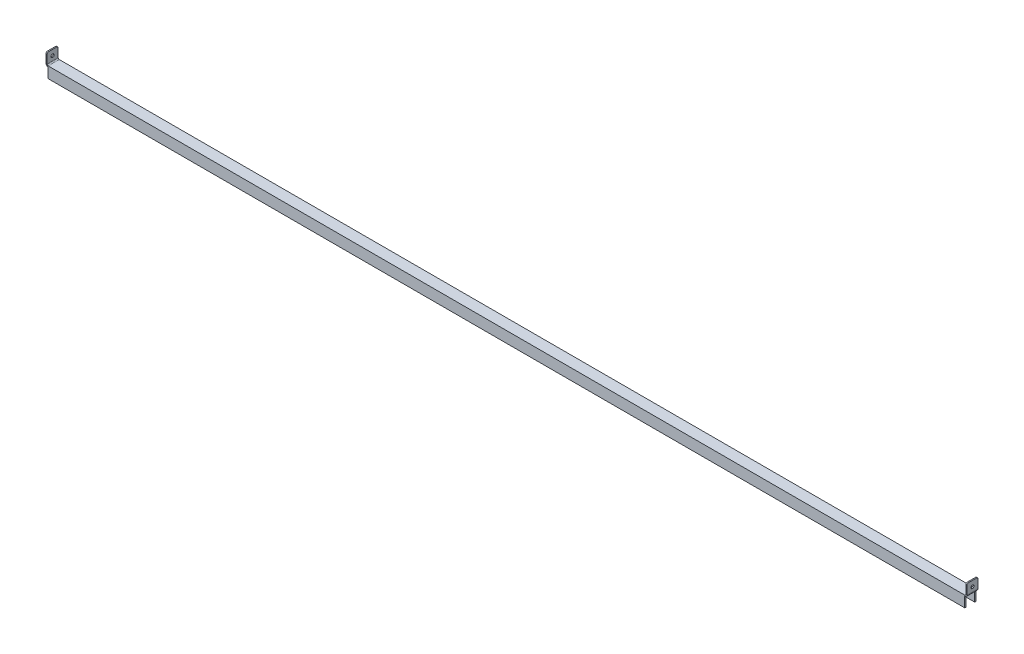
ISO-10303-21;
HEADER;
FILE_DESCRIPTION(('STEP AP214'),'2;1');
FILE_NAME('part.step','',(''),(''),'','','');
FILE_SCHEMA(('AUTOMOTIVE_DESIGN { 1 0 10303 214 1 1 1 1 }'));
ENDSEC;
DATA;
#1=APPLICATION_CONTEXT('core data for automotive mechanical design processes');
#2=APPLICATION_PROTOCOL_DEFINITION('international standard','automotive_design',2000,#1);
#3=PRODUCT_CONTEXT('',#1,'mechanical');
#4=PRODUCT('Part','Part','',(#3));
#5=PRODUCT_RELATED_PRODUCT_CATEGORY('part','',(#4));
#6=PRODUCT_DEFINITION_FORMATION('','',#4);
#7=PRODUCT_DEFINITION_CONTEXT('part definition',#1,'design');
#8=PRODUCT_DEFINITION('design','',#6,#7);
#9=PRODUCT_DEFINITION_SHAPE('','',#8);
#10=(LENGTH_UNIT() NAMED_UNIT(*) SI_UNIT(.MILLI.,.METRE.));
#11=(NAMED_UNIT(*) PLANE_ANGLE_UNIT() SI_UNIT($,.RADIAN.));
#12=(NAMED_UNIT(*) SI_UNIT($,.STERADIAN.) SOLID_ANGLE_UNIT());
#13=UNCERTAINTY_MEASURE_WITH_UNIT(LENGTH_MEASURE(1.E-05),#10,'distance_accuracy_value','');
#14=(GEOMETRIC_REPRESENTATION_CONTEXT(3) GLOBAL_UNCERTAINTY_ASSIGNED_CONTEXT((#13)) GLOBAL_UNIT_ASSIGNED_CONTEXT((#10,
#11,#12)) REPRESENTATION_CONTEXT('',''));
#15=CARTESIAN_POINT('',(0.,0.,0.));
#16=DIRECTION('',(0.,0.,1.));
#17=DIRECTION('',(1.,0.,0.));
#18=AXIS2_PLACEMENT_3D('',#15,#16,#17);
#19=CARTESIAN_POINT('',(0.,-3.,0.));
#20=DIRECTION('',(0.,1.,0.));
#21=DIRECTION('',(0.,0.,1.));
#22=AXIS2_PLACEMENT_3D('',#19,#20,#21);
#23=PLANE('',#22);
#24=DIRECTION('',(-1.,0.,0.));
#25=VECTOR('',#24,1.);
#26=CARTESIAN_POINT('',(-1241.5,-3.,-12.));
#27=LINE('',#26,#25);
#28=CARTESIAN_POINT('',(1241.5,-3.,-11.9999999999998));
#29=VERTEX_POINT('',#28);
#30=CARTESIAN_POINT('',(-1241.5,-3.,-12.));
#31=VERTEX_POINT('',#30);
#32=EDGE_CURVE('E248',#29,#31,#27,.T.);
#33=ORIENTED_EDGE('',*,*,#32,.F.);
#34=DIRECTION('',(0.,0.,-1.));
#35=VECTOR('',#34,1.);
#36=CARTESIAN_POINT('',(1241.5,-3.,-15.));
#37=LINE('',#36,#35);
#38=CARTESIAN_POINT('',(1241.5,-3.,12.));
#39=VERTEX_POINT('',#38);
#40=EDGE_CURVE('E364',#29,#39,#37,.F.);
#41=ORIENTED_EDGE('',*,*,#40,.T.);
#42=DIRECTION('',(1.,0.,0.));
#43=VECTOR('',#42,1.);
#44=CARTESIAN_POINT('',(1241.5,-3.,12.));
#45=LINE('',#44,#43);
#46=CARTESIAN_POINT('',(-1241.5,-3.,12.));
#47=VERTEX_POINT('',#46);
#48=EDGE_CURVE('E255',#47,#39,#45,.T.);
#49=ORIENTED_EDGE('',*,*,#48,.F.);
#50=DIRECTION('',(0.,0.,1.));
#51=VECTOR('',#50,1.);
#52=CARTESIAN_POINT('',(-1241.5,-3.,15.));
#53=LINE('',#52,#51);
#54=EDGE_CURVE('E316',#47,#31,#53,.F.);
#55=ORIENTED_EDGE('',*,*,#54,.T.);
#56=EDGE_LOOP('',(#33,#41,#49,#55));
#57=FACE_BOUND('',#56,.T.);
#58=ADVANCED_FACE('F76',(#57),#23,.F.);
#59=CARTESIAN_POINT('',(0.,0.,0.));
#60=DIRECTION('',(0.,1.,0.));
#61=DIRECTION('',(0.,0.,1.));
#62=AXIS2_PLACEMENT_3D('',#59,#60,#61);
#63=PLANE('',#62);
#64=DIRECTION('',(-1.,0.,0.));
#65=VECTOR('',#64,1.);
#66=CARTESIAN_POINT('',(-1247.5,0.,-15.));
#67=LINE('',#66,#65);
#68=CARTESIAN_POINT('',(1241.5,0.,-15.));
#69=VERTEX_POINT('',#68);
#70=CARTESIAN_POINT('',(-1241.5,0.,-15.));
#71=VERTEX_POINT('',#70);
#72=EDGE_CURVE('E384',#69,#71,#67,.T.);
#73=ORIENTED_EDGE('',*,*,#72,.T.);
#74=DIRECTION('',(0.,0.,1.));
#75=VECTOR('',#74,1.);
#76=CARTESIAN_POINT('',(-1241.5,0.,15.));
#77=LINE('',#76,#75);
#78=CARTESIAN_POINT('',(-1241.5,0.,15.));
#79=VERTEX_POINT('',#78);
#80=EDGE_CURVE('E326',#79,#71,#77,.F.);
#81=ORIENTED_EDGE('',*,*,#80,.F.);
#82=DIRECTION('',(1.,0.,0.));
#83=VECTOR('',#82,1.);
#84=CARTESIAN_POINT('',(-1247.5,0.,15.));
#85=LINE('',#84,#83);
#86=CARTESIAN_POINT('',(1241.5,0.,15.));
#87=VERTEX_POINT('',#86);
#88=EDGE_CURVE('E381',#79,#87,#85,.T.);
#89=ORIENTED_EDGE('',*,*,#88,.T.);
#90=DIRECTION('',(0.,0.,-1.));
#91=VECTOR('',#90,1.);
#92=CARTESIAN_POINT('',(1241.5,0.,-15.));
#93=LINE('',#92,#91);
#94=EDGE_CURVE('E374',#69,#87,#93,.F.);
#95=ORIENTED_EDGE('',*,*,#94,.F.);
#96=EDGE_LOOP('',(#73,#81,#89,#95));
#97=FACE_BOUND('',#96,.T.);
#98=ADVANCED_FACE('F459',(#97),#63,.T.);
#99=CARTESIAN_POINT('',(-1247.5,-3.,15.));
#100=DIRECTION('',(0.,0.,1.));
#101=DIRECTION('',(1.,0.,0.));
#102=AXIS2_PLACEMENT_3D('',#99,#100,#101);
#103=PLANE('',#102);
#104=ORIENTED_EDGE('',*,*,#88,.F.);
#105=DIRECTION('',(0.,-1.,0.));
#106=VECTOR('',#105,1.);
#107=CARTESIAN_POINT('',(-1241.5,0.,15.));
#108=LINE('',#107,#106);
#109=CARTESIAN_POINT('',(-1241.5,-3.,15.));
#110=VERTEX_POINT('',#109);
#111=EDGE_CURVE('E319',#79,#110,#108,.T.);
#112=ORIENTED_EDGE('',*,*,#111,.T.);
#113=DIRECTION('',(0.,1.,0.));
#114=VECTOR('',#113,1.);
#115=CARTESIAN_POINT('',(-1241.5,-30.,15.));
#116=LINE('',#115,#114);
#117=CARTESIAN_POINT('',(-1241.5,-30.,15.));
#118=VERTEX_POINT('',#117);
#119=EDGE_CURVE('E278',#118,#110,#116,.T.);
#120=ORIENTED_EDGE('',*,*,#119,.F.);
#121=DIRECTION('',(-1.,0.,0.));
#122=VECTOR('',#121,1.);
#123=CARTESIAN_POINT('',(1241.5,-30.,15.));
#124=LINE('',#123,#122);
#125=CARTESIAN_POINT('',(1241.5,-30.,15.));
#126=VERTEX_POINT('',#125);
#127=EDGE_CURVE('E264',#126,#118,#124,.T.);
#128=ORIENTED_EDGE('',*,*,#127,.F.);
#129=DIRECTION('',(0.,1.,0.));
#130=VECTOR('',#129,1.);
#131=CARTESIAN_POINT('',(1241.5,-30.,15.));
#132=LINE('',#131,#130);
#133=CARTESIAN_POINT('',(1241.5,-3.,15.));
#134=VERTEX_POINT('',#133);
#135=EDGE_CURVE('E281',#126,#134,#132,.T.);
#136=ORIENTED_EDGE('',*,*,#135,.T.);
#137=DIRECTION('',(0.,-1.,0.));
#138=VECTOR('',#137,1.);
#139=CARTESIAN_POINT('',(1241.5,0.,15.));
#140=LINE('',#139,#138);
#141=EDGE_CURVE('E379',#87,#134,#140,.T.);
#142=ORIENTED_EDGE('',*,*,#141,.F.);
#143=EDGE_LOOP('',(#104,#112,#120,#128,#136,#142));
#144=FACE_BOUND('',#143,.T.);
#145=ADVANCED_FACE('F514',(#144),#103,.T.);
#146=CARTESIAN_POINT('',(-1247.5,-3.,-15.));
#147=DIRECTION('',(0.,0.,-1.));
#148=DIRECTION('',(-1.,0.,0.));
#149=AXIS2_PLACEMENT_3D('',#146,#147,#148);
#150=PLANE('',#149);
#151=DIRECTION('',(0.,-1.,0.));
#152=VECTOR('',#151,1.);
#153=CARTESIAN_POINT('',(-1241.5,0.,-15.));
#154=LINE('',#153,#152);
#155=CARTESIAN_POINT('',(-1241.5,-3.,-15.));
#156=VERTEX_POINT('',#155);
#157=EDGE_CURVE('E331',#71,#156,#154,.T.);
#158=ORIENTED_EDGE('',*,*,#157,.F.);
#159=ORIENTED_EDGE('',*,*,#72,.F.);
#160=DIRECTION('',(0.,-1.,0.));
#161=VECTOR('',#160,1.);
#162=CARTESIAN_POINT('',(1241.5,0.,-15.));
#163=LINE('',#162,#161);
#164=CARTESIAN_POINT('',(1241.5,-3.,-15.));
#165=VERTEX_POINT('',#164);
#166=EDGE_CURVE('E367',#69,#165,#163,.T.);
#167=ORIENTED_EDGE('',*,*,#166,.T.);
#168=DIRECTION('',(0.,1.,0.));
#169=VECTOR('',#168,1.);
#170=CARTESIAN_POINT('',(1241.5,-30.,-14.9999999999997));
#171=LINE('',#170,#169);
#172=CARTESIAN_POINT('',(1241.5,-30.,-14.9999999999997));
#173=VERTEX_POINT('',#172);
#174=EDGE_CURVE('E235',#173,#165,#171,.T.);
#175=ORIENTED_EDGE('',*,*,#174,.F.);
#176=DIRECTION('',(1.,0.,0.));
#177=VECTOR('',#176,1.);
#178=CARTESIAN_POINT('',(-1241.5,-30.,-15.));
#179=LINE('',#178,#177);
#180=CARTESIAN_POINT('',(-1241.5,-30.,-15.));
#181=VERTEX_POINT('',#180);
#182=EDGE_CURVE('E228',#181,#173,#179,.T.);
#183=ORIENTED_EDGE('',*,*,#182,.F.);
#184=DIRECTION('',(0.,1.,0.));
#185=VECTOR('',#184,1.);
#186=CARTESIAN_POINT('',(-1241.5,-30.,-15.));
#187=LINE('',#186,#185);
#188=EDGE_CURVE('E232',#181,#156,#187,.T.);
#189=ORIENTED_EDGE('',*,*,#188,.T.);
#190=EDGE_LOOP('',(#158,#159,#167,#175,#183,#189));
#191=FACE_BOUND('',#190,.T.);
#192=ADVANCED_FACE('F230',(#191),#150,.T.);
#193=CARTESIAN_POINT('',(1241.5,2.99999999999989,15.));
#194=DIRECTION('',(0.,0.,1.));
#195=DIRECTION('',(1.,0.,0.));
#196=AXIS2_PLACEMENT_3D('',#193,#194,#195);
#197=PLANE('',#196);
#198=DIRECTION('',(-1.,0.,0.));
#199=VECTOR('',#198,1.);
#200=CARTESIAN_POINT('',(1247.5,2.99999999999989,15.));
#201=LINE('',#200,#199);
#202=CARTESIAN_POINT('',(1244.5,2.99999999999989,15.));
#203=VERTEX_POINT('',#202);
#204=CARTESIAN_POINT('',(1247.5,2.99999999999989,15.));
#205=VERTEX_POINT('',#204);
#206=EDGE_CURVE('E334',#203,#205,#201,.F.);
#207=ORIENTED_EDGE('',*,*,#206,.F.);
#208=CARTESIAN_POINT('',(1241.5,2.99999999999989,15.));
#209=DIRECTION('',(0.,0.,-1.));
#210=DIRECTION('',(-1.,0.,0.));
#211=AXIS2_PLACEMENT_3D('',#208,#209,#210);
#212=CIRCLE('',#211,2.99999999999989);
#213=EDGE_CURVE('E371',#87,#203,#212,.F.);
#214=ORIENTED_EDGE('',*,*,#213,.F.);
#215=ORIENTED_EDGE('',*,*,#141,.T.);
#216=CARTESIAN_POINT('',(1241.5,2.99999999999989,15.));
#217=DIRECTION('',(0.,0.,-1.));
#218=DIRECTION('',(-1.,0.,0.));
#219=AXIS2_PLACEMENT_3D('',#216,#217,#218);
#220=CIRCLE('',#219,5.99999999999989);
#221=EDGE_CURVE('E363',#134,#205,#220,.F.);
#222=ORIENTED_EDGE('',*,*,#221,.T.);
#223=EDGE_LOOP('',(#207,#214,#215,#222));
#224=FACE_BOUND('',#223,.T.);
#225=ADVANCED_FACE('F448',(#224),#197,.T.);
#226=CARTESIAN_POINT('',(1241.5,2.99999999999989,-15.));
#227=DIRECTION('',(0.,0.,1.));
#228=DIRECTION('',(1.,0.,0.));
#229=AXIS2_PLACEMENT_3D('',#226,#227,#228);
#230=PLANE('',#229);
#231=CARTESIAN_POINT('',(1241.5,2.99999999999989,-15.));
#232=DIRECTION('',(0.,0.,-1.));
#233=DIRECTION('',(-1.,0.,0.));
#234=AXIS2_PLACEMENT_3D('',#231,#232,#233);
#235=CIRCLE('',#234,2.99999999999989);
#236=CARTESIAN_POINT('',(1244.5,2.99999999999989,-15.));
#237=VERTEX_POINT('',#236);
#238=EDGE_CURVE('E338',#237,#69,#235,.T.);
#239=ORIENTED_EDGE('',*,*,#238,.F.);
#240=DIRECTION('',(-1.,0.,0.));
#241=VECTOR('',#240,1.);
#242=CARTESIAN_POINT('',(1244.5,2.99999999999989,-15.));
#243=LINE('',#242,#241);
#244=CARTESIAN_POINT('',(1247.5,2.99999999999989,-15.));
#245=VERTEX_POINT('',#244);
#246=EDGE_CURVE('E353',#237,#245,#243,.F.);
#247=ORIENTED_EDGE('',*,*,#246,.T.);
#248=CARTESIAN_POINT('',(1241.5,2.99999999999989,-15.));
#249=DIRECTION('',(0.,0.,-1.));
#250=DIRECTION('',(-1.,0.,0.));
#251=AXIS2_PLACEMENT_3D('',#248,#249,#250);
#252=CIRCLE('',#251,5.99999999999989);
#253=EDGE_CURVE('E368',#245,#165,#252,.T.);
#254=ORIENTED_EDGE('',*,*,#253,.T.);
#255=ORIENTED_EDGE('',*,*,#166,.F.);
#256=EDGE_LOOP('',(#239,#247,#254,#255));
#257=FACE_BOUND('',#256,.T.);
#258=ADVANCED_FACE('F439',(#257),#230,.F.);
#259=CARTESIAN_POINT('',(1241.5,2.99999999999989,-15.));
#260=DIRECTION('',(0.,0.,-1.));
#261=DIRECTION('',(1.,0.,0.));
#262=AXIS2_PLACEMENT_3D('',#259,#260,#261);
#263=CYLINDRICAL_SURFACE('',#262,5.99999999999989);
#264=EDGE_CURVE('E360',#165,#29,#37,.F.);
#265=ORIENTED_EDGE('',*,*,#264,.F.);
#266=ORIENTED_EDGE('',*,*,#253,.F.);
#267=DIRECTION('',(0.,0.,-1.));
#268=VECTOR('',#267,1.);
#269=CARTESIAN_POINT('',(1247.5,2.99999999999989,15.));
#270=LINE('',#269,#268);
#271=EDGE_CURVE('E350',#245,#205,#270,.F.);
#272=ORIENTED_EDGE('',*,*,#271,.T.);
#273=ORIENTED_EDGE('',*,*,#221,.F.);
#274=DIRECTION('',(0.,0.,1.));
#275=VECTOR('',#274,1.);
#276=CARTESIAN_POINT('',(1241.5,-3.,15.));
#277=LINE('',#276,#275);
#278=EDGE_CURVE('E252',#39,#134,#277,.T.);
#279=ORIENTED_EDGE('',*,*,#278,.F.);
#280=ORIENTED_EDGE('',*,*,#40,.F.);
#281=EDGE_LOOP('',(#265,#266,#272,#273,#279,#280));
#282=FACE_BOUND('',#281,.T.);
#283=ADVANCED_FACE('F444',(#282),#263,.T.);
#284=CARTESIAN_POINT('',(1241.5,2.99999999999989,-15.));
#285=DIRECTION('',(0.,0.,-1.));
#286=DIRECTION('',(1.,0.,0.));
#287=AXIS2_PLACEMENT_3D('',#284,#285,#286);
#288=CYLINDRICAL_SURFACE('',#287,2.99999999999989);
#289=ORIENTED_EDGE('',*,*,#94,.T.);
#290=ORIENTED_EDGE('',*,*,#213,.T.);
#291=DIRECTION('',(0.,0.,-1.));
#292=VECTOR('',#291,1.);
#293=CARTESIAN_POINT('',(1244.5,2.99999999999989,15.));
#294=LINE('',#293,#292);
#295=EDGE_CURVE('E356',#203,#237,#294,.T.);
#296=ORIENTED_EDGE('',*,*,#295,.T.);
#297=ORIENTED_EDGE('',*,*,#238,.T.);
#298=EDGE_LOOP('',(#289,#290,#296,#297));
#299=FACE_BOUND('',#298,.T.);
#300=ADVANCED_FACE('F456',(#299),#288,.F.);
#301=CARTESIAN_POINT('',(1247.5,0.,15.));
#302=DIRECTION('',(0.,0.,-1.));
#303=DIRECTION('',(-1.,0.,0.));
#304=AXIS2_PLACEMENT_3D('',#301,#302,#303);
#305=PLANE('',#304);
#306=DIRECTION('',(0.,-1.,0.));
#307=VECTOR('',#306,1.);
#308=CARTESIAN_POINT('',(1247.5,0.,15.));
#309=LINE('',#308,#307);
#310=CARTESIAN_POINT('',(1247.5,26.,15.));
#311=VERTEX_POINT('',#310);
#312=EDGE_CURVE('E341',#311,#205,#309,.T.);
#313=ORIENTED_EDGE('',*,*,#312,.F.);
#314=DIRECTION('',(-1.,0.,0.));
#315=VECTOR('',#314,1.);
#316=CARTESIAN_POINT('',(1247.5,26.,15.));
#317=LINE('',#316,#315);
#318=CARTESIAN_POINT('',(1244.5,26.,15.));
#319=VERTEX_POINT('',#318);
#320=EDGE_CURVE('E13',#311,#319,#317,.T.);
#321=ORIENTED_EDGE('',*,*,#320,.T.);
#322=DIRECTION('',(0.,1.,0.));
#323=VECTOR('',#322,1.);
#324=CARTESIAN_POINT('',(1244.5,0.,15.));
#325=LINE('',#324,#323);
#326=EDGE_CURVE('E348',#319,#203,#325,.F.);
#327=ORIENTED_EDGE('',*,*,#326,.T.);
#328=ORIENTED_EDGE('',*,*,#206,.T.);
#329=EDGE_LOOP('',(#313,#321,#327,#328));
#330=FACE_BOUND('',#329,.T.);
#331=ADVANCED_FACE('F452',(#330),#305,.F.);
#332=CARTESIAN_POINT('',(1247.5,30.,-15.));
#333=DIRECTION('',(0.,0.,1.));
#334=DIRECTION('',(0.,-1.,0.));
#335=AXIS2_PLACEMENT_3D('',#332,#333,#334);
#336=PLANE('',#335);
#337=DIRECTION('',(0.,-1.,0.));
#338=VECTOR('',#337,1.);
#339=CARTESIAN_POINT('',(1244.5,30.,-15.));
#340=LINE('',#339,#338);
#341=CARTESIAN_POINT('',(1244.5,26.,-15.));
#342=VERTEX_POINT('',#341);
#343=EDGE_CURVE('E346',#237,#342,#340,.F.);
#344=ORIENTED_EDGE('',*,*,#343,.T.);
#345=DIRECTION('',(-1.,0.,0.));
#346=VECTOR('',#345,1.);
#347=CARTESIAN_POINT('',(1247.5,26.,-15.));
#348=LINE('',#347,#346);
#349=CARTESIAN_POINT('',(1247.5,26.,-15.));
#350=VERTEX_POINT('',#349);
#351=EDGE_CURVE('E99',#342,#350,#348,.F.);
#352=ORIENTED_EDGE('',*,*,#351,.T.);
#353=DIRECTION('',(0.,1.,0.));
#354=VECTOR('',#353,1.);
#355=CARTESIAN_POINT('',(1247.5,0.,-15.));
#356=LINE('',#355,#354);
#357=EDGE_CURVE('E339',#245,#350,#356,.T.);
#358=ORIENTED_EDGE('',*,*,#357,.F.);
#359=ORIENTED_EDGE('',*,*,#246,.F.);
#360=EDGE_LOOP('',(#344,#352,#358,#359));
#361=FACE_BOUND('',#360,.T.);
#362=ADVANCED_FACE('F436',(#361),#336,.F.);
#363=CARTESIAN_POINT('',(1247.5,0.,0.));
#364=DIRECTION('',(-1.,0.,0.));
#365=DIRECTION('',(0.,0.,1.));
#366=AXIS2_PLACEMENT_3D('',#363,#364,#365);
#367=PLANE('',#366);
#368=CARTESIAN_POINT('',(1247.5,15.,0.));
#369=DIRECTION('',(1.,0.,0.));
#370=DIRECTION('',(0.,0.,-1.));
#371=AXIS2_PLACEMENT_3D('',#368,#369,#370);
#372=CIRCLE('',#371,4.25);
#373=CARTESIAN_POINT('',(1247.5,15.,-4.25));
#374=VERTEX_POINT('',#373);
#375=EDGE_CURVE('E888',#374,#374,#372,.T.);
#376=ORIENTED_EDGE('',*,*,#375,.F.);
#377=EDGE_LOOP('',(#376));
#378=FACE_BOUND('',#377,.T.);
#379=ORIENTED_EDGE('',*,*,#357,.T.);
#380=CARTESIAN_POINT('',(1247.5,26.,-11.));
#381=DIRECTION('',(-1.,0.,0.));
#382=DIRECTION('',(0.,0.,1.));
#383=AXIS2_PLACEMENT_3D('',#380,#381,#382);
#384=CIRCLE('',#383,4.);
#385=CARTESIAN_POINT('',(1247.5,30.,-11.));
#386=VERTEX_POINT('',#385);
#387=EDGE_CURVE('E84',#350,#386,#384,.F.);
#388=ORIENTED_EDGE('',*,*,#387,.T.);
#389=DIRECTION('',(0.,0.,1.));
#390=VECTOR('',#389,1.);
#391=CARTESIAN_POINT('',(1247.5,30.,0.));
#392=LINE('',#391,#390);
#393=CARTESIAN_POINT('',(1247.5,30.,11.));
#394=VERTEX_POINT('',#393);
#395=EDGE_CURVE('E336',#386,#394,#392,.T.);
#396=ORIENTED_EDGE('',*,*,#395,.T.);
#397=CARTESIAN_POINT('',(1247.5,26.,11.));
#398=DIRECTION('',(-1.,0.,0.));
#399=DIRECTION('',(0.,0.,1.));
#400=AXIS2_PLACEMENT_3D('',#397,#398,#399);
#401=CIRCLE('',#400,4.);
#402=EDGE_CURVE('E91',#394,#311,#401,.F.);
#403=ORIENTED_EDGE('',*,*,#402,.T.);
#404=ORIENTED_EDGE('',*,*,#312,.T.);
#405=ORIENTED_EDGE('',*,*,#271,.F.);
#406=EDGE_LOOP('',(#379,#388,#396,#403,#404,#405));
#407=FACE_BOUND('',#406,.T.);
#408=ADVANCED_FACE('F422',(#378,#407),#367,.F.);
#409=CARTESIAN_POINT('',(1244.5,0.,0.));
#410=DIRECTION('',(-1.,0.,0.));
#411=DIRECTION('',(0.,0.,1.));
#412=AXIS2_PLACEMENT_3D('',#409,#410,#411);
#413=PLANE('',#412);
#414=CARTESIAN_POINT('',(1244.5,15.,0.));
#415=DIRECTION('',(-1.,0.,0.));
#416=DIRECTION('',(0.,0.,1.));
#417=AXIS2_PLACEMENT_3D('',#414,#415,#416);
#418=CIRCLE('',#417,4.25);
#419=CARTESIAN_POINT('',(1244.5,15.,-4.25));
#420=VERTEX_POINT('',#419);
#421=EDGE_CURVE('E391',#420,#420,#418,.T.);
#422=ORIENTED_EDGE('',*,*,#421,.F.);
#423=EDGE_LOOP('',(#422));
#424=FACE_BOUND('',#423,.T.);
#425=DIRECTION('',(0.,0.,-1.));
#426=VECTOR('',#425,1.);
#427=CARTESIAN_POINT('',(1244.5,30.,15.));
#428=LINE('',#427,#426);
#429=CARTESIAN_POINT('',(1244.5,30.,-11.));
#430=VERTEX_POINT('',#429);
#431=CARTESIAN_POINT('',(1244.5,30.,11.));
#432=VERTEX_POINT('',#431);
#433=EDGE_CURVE('E343',#430,#432,#428,.F.);
#434=ORIENTED_EDGE('',*,*,#433,.F.);
#435=CARTESIAN_POINT('',(1244.5,26.,-11.));
#436=DIRECTION('',(-1.,0.,0.));
#437=DIRECTION('',(0.,0.,1.));
#438=AXIS2_PLACEMENT_3D('',#435,#436,#437);
#439=CIRCLE('',#438,4.);
#440=EDGE_CURVE('E417',#430,#342,#439,.T.);
#441=ORIENTED_EDGE('',*,*,#440,.T.);
#442=ORIENTED_EDGE('',*,*,#343,.F.);
#443=ORIENTED_EDGE('',*,*,#295,.F.);
#444=ORIENTED_EDGE('',*,*,#326,.F.);
#445=CARTESIAN_POINT('',(1244.5,26.,11.));
#446=DIRECTION('',(-1.,0.,0.));
#447=DIRECTION('',(0.,0.,1.));
#448=AXIS2_PLACEMENT_3D('',#445,#446,#447);
#449=CIRCLE('',#448,4.);
#450=EDGE_CURVE('E415',#319,#432,#449,.T.);
#451=ORIENTED_EDGE('',*,*,#450,.T.);
#452=EDGE_LOOP('',(#434,#441,#442,#443,#444,#451));
#453=FACE_BOUND('',#452,.T.);
#454=ADVANCED_FACE('F433',(#424,#453),#413,.T.);
#455=CARTESIAN_POINT('',(1247.5,30.,15.));
#456=DIRECTION('',(0.,-1.,0.));
#457=DIRECTION('',(1.,0.,0.));
#458=AXIS2_PLACEMENT_3D('',#455,#456,#457);
#459=PLANE('',#458);
#460=ORIENTED_EDGE('',*,*,#395,.F.);
#461=DIRECTION('',(-1.,0.,0.));
#462=VECTOR('',#461,1.);
#463=CARTESIAN_POINT('',(1247.5,30.,-11.));
#464=LINE('',#463,#462);
#465=EDGE_CURVE('E412',#386,#430,#464,.T.);
#466=ORIENTED_EDGE('',*,*,#465,.T.);
#467=ORIENTED_EDGE('',*,*,#433,.T.);
#468=DIRECTION('',(-1.,0.,0.));
#469=VECTOR('',#468,1.);
#470=CARTESIAN_POINT('',(1247.5,30.,11.));
#471=LINE('',#470,#469);
#472=EDGE_CURVE('E410',#432,#394,#471,.F.);
#473=ORIENTED_EDGE('',*,*,#472,.T.);
#474=EDGE_LOOP('',(#460,#466,#467,#473));
#475=FACE_BOUND('',#474,.T.);
#476=ADVANCED_FACE('F427',(#475),#459,.F.);
#477=CARTESIAN_POINT('',(-1241.5,2.99999999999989,-15.));
#478=DIRECTION('',(0.,0.,-1.));
#479=DIRECTION('',(-1.,0.,0.));
#480=AXIS2_PLACEMENT_3D('',#477,#478,#479);
#481=PLANE('',#480);
#482=DIRECTION('',(1.,0.,0.));
#483=VECTOR('',#482,1.);
#484=CARTESIAN_POINT('',(-1247.5,2.99999999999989,-15.));
#485=LINE('',#484,#483);
#486=CARTESIAN_POINT('',(-1244.5,2.99999999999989,-15.));
#487=VERTEX_POINT('',#486);
#488=CARTESIAN_POINT('',(-1247.5,2.99999999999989,-15.));
#489=VERTEX_POINT('',#488);
#490=EDGE_CURVE('E284',#487,#489,#485,.F.);
#491=ORIENTED_EDGE('',*,*,#490,.F.);
#492=CARTESIAN_POINT('',(-1241.5,2.99999999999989,-15.));
#493=DIRECTION('',(0.,0.,1.));
#494=DIRECTION('',(1.,0.,0.));
#495=AXIS2_PLACEMENT_3D('',#492,#493,#494);
#496=CIRCLE('',#495,2.99999999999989);
#497=EDGE_CURVE('E323',#71,#487,#496,.F.);
#498=ORIENTED_EDGE('',*,*,#497,.F.);
#499=ORIENTED_EDGE('',*,*,#157,.T.);
#500=CARTESIAN_POINT('',(-1241.5,2.99999999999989,-15.));
#501=DIRECTION('',(0.,0.,1.));
#502=DIRECTION('',(1.,0.,0.));
#503=AXIS2_PLACEMENT_3D('',#500,#501,#502);
#504=CIRCLE('',#503,5.99999999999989);
#505=EDGE_CURVE('E315',#156,#489,#504,.F.);
#506=ORIENTED_EDGE('',*,*,#505,.T.);
#507=EDGE_LOOP('',(#491,#498,#499,#506));
#508=FACE_BOUND('',#507,.T.);
#509=ADVANCED_FACE('F464',(#508),#481,.T.);
#510=CARTESIAN_POINT('',(-1241.5,2.99999999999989,15.));
#511=DIRECTION('',(0.,0.,-1.));
#512=DIRECTION('',(-1.,0.,0.));
#513=AXIS2_PLACEMENT_3D('',#510,#511,#512);
#514=PLANE('',#513);
#515=CARTESIAN_POINT('',(-1241.5,2.99999999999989,15.));
#516=DIRECTION('',(0.,0.,1.));
#517=DIRECTION('',(1.,0.,0.));
#518=AXIS2_PLACEMENT_3D('',#515,#516,#517);
#519=CIRCLE('',#518,2.99999999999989);
#520=CARTESIAN_POINT('',(-1244.5,2.99999999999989,15.));
#521=VERTEX_POINT('',#520);
#522=EDGE_CURVE('E287',#521,#79,#519,.T.);
#523=ORIENTED_EDGE('',*,*,#522,.F.);
#524=DIRECTION('',(1.,0.,0.));
#525=VECTOR('',#524,1.);
#526=CARTESIAN_POINT('',(-1244.5,2.99999999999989,15.));
#527=LINE('',#526,#525);
#528=CARTESIAN_POINT('',(-1247.5,2.99999999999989,15.));
#529=VERTEX_POINT('',#528);
#530=EDGE_CURVE('E305',#521,#529,#527,.F.);
#531=ORIENTED_EDGE('',*,*,#530,.T.);
#532=CARTESIAN_POINT('',(-1241.5,2.99999999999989,15.));
#533=DIRECTION('',(0.,0.,1.));
#534=DIRECTION('',(1.,0.,0.));
#535=AXIS2_PLACEMENT_3D('',#532,#533,#534);
#536=CIRCLE('',#535,5.99999999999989);
#537=EDGE_CURVE('E320',#529,#110,#536,.T.);
#538=ORIENTED_EDGE('',*,*,#537,.T.);
#539=ORIENTED_EDGE('',*,*,#111,.F.);
#540=EDGE_LOOP('',(#523,#531,#538,#539));
#541=FACE_BOUND('',#540,.T.);
#542=ADVANCED_FACE('F748',(#541),#514,.F.);
#543=CARTESIAN_POINT('',(-1241.5,2.99999999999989,15.));
#544=DIRECTION('',(0.,0.,1.));
#545=DIRECTION('',(-1.,0.,0.));
#546=AXIS2_PLACEMENT_3D('',#543,#544,#545);
#547=CYLINDRICAL_SURFACE('',#546,5.99999999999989);
#548=EDGE_CURVE('E312',#110,#47,#53,.F.);
#549=ORIENTED_EDGE('',*,*,#548,.F.);
#550=ORIENTED_EDGE('',*,*,#537,.F.);
#551=DIRECTION('',(0.,0.,1.));
#552=VECTOR('',#551,1.);
#553=CARTESIAN_POINT('',(-1247.5,2.99999999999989,-15.));
#554=LINE('',#553,#552);
#555=EDGE_CURVE('E302',#529,#489,#554,.F.);
#556=ORIENTED_EDGE('',*,*,#555,.T.);
#557=ORIENTED_EDGE('',*,*,#505,.F.);
#558=DIRECTION('',(0.,0.,-1.));
#559=VECTOR('',#558,1.);
#560=CARTESIAN_POINT('',(-1241.5,-3.,-15.));
#561=LINE('',#560,#559);
#562=EDGE_CURVE('E251',#31,#156,#561,.T.);
#563=ORIENTED_EDGE('',*,*,#562,.F.);
#564=ORIENTED_EDGE('',*,*,#54,.F.);
#565=EDGE_LOOP('',(#549,#550,#556,#557,#563,#564));
#566=FACE_BOUND('',#565,.T.);
#567=ADVANCED_FACE('F743',(#566),#547,.T.);
#568=CARTESIAN_POINT('',(-1241.5,2.99999999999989,15.));
#569=DIRECTION('',(0.,0.,1.));
#570=DIRECTION('',(-1.,0.,0.));
#571=AXIS2_PLACEMENT_3D('',#568,#569,#570);
#572=CYLINDRICAL_SURFACE('',#571,2.99999999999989);
#573=ORIENTED_EDGE('',*,*,#80,.T.);
#574=ORIENTED_EDGE('',*,*,#497,.T.);
#575=DIRECTION('',(0.,0.,1.));
#576=VECTOR('',#575,1.);
#577=CARTESIAN_POINT('',(-1244.5,2.99999999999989,-15.));
#578=LINE('',#577,#576);
#579=EDGE_CURVE('E308',#487,#521,#578,.T.);
#580=ORIENTED_EDGE('',*,*,#579,.T.);
#581=ORIENTED_EDGE('',*,*,#522,.T.);
#582=EDGE_LOOP('',(#573,#574,#580,#581));
#583=FACE_BOUND('',#582,.T.);
#584=ADVANCED_FACE('F467',(#583),#572,.F.);
#585=CARTESIAN_POINT('',(-1247.5,30.,15.));
#586=DIRECTION('',(0.,0.,-1.));
#587=DIRECTION('',(0.,1.,0.));
#588=AXIS2_PLACEMENT_3D('',#585,#586,#587);
#589=PLANE('',#588);
#590=DIRECTION('',(0.,-1.,0.));
#591=VECTOR('',#590,1.);
#592=CARTESIAN_POINT('',(-1244.5,30.,15.));
#593=LINE('',#592,#591);
#594=CARTESIAN_POINT('',(-1244.5,26.,15.));
#595=VERTEX_POINT('',#594);
#596=EDGE_CURVE('E299',#521,#595,#593,.F.);
#597=ORIENTED_EDGE('',*,*,#596,.T.);
#598=DIRECTION('',(1.,0.,0.));
#599=VECTOR('',#598,1.);
#600=CARTESIAN_POINT('',(-1247.5,26.,15.));
#601=LINE('',#600,#599);
#602=CARTESIAN_POINT('',(-1247.5,26.,15.));
#603=VERTEX_POINT('',#602);
#604=EDGE_CURVE('E408',#595,#603,#601,.F.);
#605=ORIENTED_EDGE('',*,*,#604,.T.);
#606=DIRECTION('',(0.,1.,0.));
#607=VECTOR('',#606,1.);
#608=CARTESIAN_POINT('',(-1247.5,0.,15.));
#609=LINE('',#608,#607);
#610=EDGE_CURVE('E291',#529,#603,#609,.T.);
#611=ORIENTED_EDGE('',*,*,#610,.F.);
#612=ORIENTED_EDGE('',*,*,#530,.F.);
#613=EDGE_LOOP('',(#597,#605,#611,#612));
#614=FACE_BOUND('',#613,.T.);
#615=ADVANCED_FACE('F477',(#614),#589,.F.);
#616=CARTESIAN_POINT('',(-1247.5,0.,-15.));
#617=DIRECTION('',(0.,0.,1.));
#618=DIRECTION('',(0.,-1.,0.));
#619=AXIS2_PLACEMENT_3D('',#616,#617,#618);
#620=PLANE('',#619);
#621=DIRECTION('',(0.,-1.,0.));
#622=VECTOR('',#621,1.);
#623=CARTESIAN_POINT('',(-1247.5,0.,-15.));
#624=LINE('',#623,#622);
#625=CARTESIAN_POINT('',(-1247.5,26.,-15.));
#626=VERTEX_POINT('',#625);
#627=EDGE_CURVE('E285',#626,#489,#624,.T.);
#628=ORIENTED_EDGE('',*,*,#627,.F.);
#629=DIRECTION('',(1.,0.,0.));
#630=VECTOR('',#629,1.);
#631=CARTESIAN_POINT('',(-1247.5,26.,-15.));
#632=LINE('',#631,#630);
#633=CARTESIAN_POINT('',(-1244.5,26.,-15.));
#634=VERTEX_POINT('',#633);
#635=EDGE_CURVE('E387',#626,#634,#632,.T.);
#636=ORIENTED_EDGE('',*,*,#635,.T.);
#637=DIRECTION('',(0.,1.,0.));
#638=VECTOR('',#637,1.);
#639=CARTESIAN_POINT('',(-1244.5,0.,-15.));
#640=LINE('',#639,#638);
#641=EDGE_CURVE('E294',#634,#487,#640,.F.);
#642=ORIENTED_EDGE('',*,*,#641,.T.);
#643=ORIENTED_EDGE('',*,*,#490,.T.);
#644=EDGE_LOOP('',(#628,#636,#642,#643));
#645=FACE_BOUND('',#644,.T.);
#646=ADVANCED_FACE('F496',(#645),#620,.F.);
#647=CARTESIAN_POINT('',(-1247.5,0.,0.));
#648=DIRECTION('',(1.,0.,0.));
#649=DIRECTION('',(0.,0.,-1.));
#650=AXIS2_PLACEMENT_3D('',#647,#648,#649);
#651=PLANE('',#650);
#652=CARTESIAN_POINT('',(-1247.5,15.,0.));
#653=DIRECTION('',(1.,0.,0.));
#654=DIRECTION('',(0.,0.,-1.));
#655=AXIS2_PLACEMENT_3D('',#652,#653,#654);
#656=CIRCLE('',#655,4.25);
#657=CARTESIAN_POINT('',(-1247.5,15.,-4.25));
#658=VERTEX_POINT('',#657);
#659=EDGE_CURVE('E392',#658,#658,#656,.T.);
#660=ORIENTED_EDGE('',*,*,#659,.T.);
#661=EDGE_LOOP('',(#660));
#662=FACE_BOUND('',#661,.T.);
#663=DIRECTION('',(0.,0.,-1.));
#664=VECTOR('',#663,1.);
#665=CARTESIAN_POINT('',(-1247.5,30.,0.));
#666=LINE('',#665,#664);
#667=CARTESIAN_POINT('',(-1247.5,30.,11.));
#668=VERTEX_POINT('',#667);
#669=CARTESIAN_POINT('',(-1247.5,30.,-11.));
#670=VERTEX_POINT('',#669);
#671=EDGE_CURVE('E288',#668,#670,#666,.T.);
#672=ORIENTED_EDGE('',*,*,#671,.T.);
#673=CARTESIAN_POINT('',(-1247.5,26.,-11.));
#674=DIRECTION('',(1.,0.,0.));
#675=DIRECTION('',(0.,0.,-1.));
#676=AXIS2_PLACEMENT_3D('',#673,#674,#675);
#677=CIRCLE('',#676,4.);
#678=EDGE_CURVE('E406',#670,#626,#677,.F.);
#679=ORIENTED_EDGE('',*,*,#678,.T.);
#680=ORIENTED_EDGE('',*,*,#627,.T.);
#681=ORIENTED_EDGE('',*,*,#555,.F.);
#682=ORIENTED_EDGE('',*,*,#610,.T.);
#683=CARTESIAN_POINT('',(-1247.5,26.,11.));
#684=DIRECTION('',(1.,0.,0.));
#685=DIRECTION('',(0.,0.,-1.));
#686=AXIS2_PLACEMENT_3D('',#683,#684,#685);
#687=CIRCLE('',#686,4.);
#688=EDGE_CURVE('E404',#603,#668,#687,.F.);
#689=ORIENTED_EDGE('',*,*,#688,.T.);
#690=EDGE_LOOP('',(#672,#679,#680,#681,#682,#689));
#691=FACE_BOUND('',#690,.T.);
#692=ADVANCED_FACE('F485',(#662,#691),#651,.F.);
#693=CARTESIAN_POINT('',(-1244.5,0.,0.));
#694=DIRECTION('',(1.,0.,0.));
#695=DIRECTION('',(0.,0.,-1.));
#696=AXIS2_PLACEMENT_3D('',#693,#694,#695);
#697=PLANE('',#696);
#698=CARTESIAN_POINT('',(-1244.5,15.,0.));
#699=DIRECTION('',(1.,0.,0.));
#700=DIRECTION('',(0.,0.,-1.));
#701=AXIS2_PLACEMENT_3D('',#698,#699,#700);
#702=CIRCLE('',#701,4.25);
#703=CARTESIAN_POINT('',(-1244.5,15.,-4.25));
#704=VERTEX_POINT('',#703);
#705=EDGE_CURVE('E388',#704,#704,#702,.T.);
#706=ORIENTED_EDGE('',*,*,#705,.F.);
#707=EDGE_LOOP('',(#706));
#708=FACE_BOUND('',#707,.T.);
#709=ORIENTED_EDGE('',*,*,#641,.F.);
#710=CARTESIAN_POINT('',(-1244.5,26.,-11.));
#711=DIRECTION('',(1.,0.,0.));
#712=DIRECTION('',(0.,0.,-1.));
#713=AXIS2_PLACEMENT_3D('',#710,#711,#712);
#714=CIRCLE('',#713,4.);
#715=CARTESIAN_POINT('',(-1244.5,30.,-11.));
#716=VERTEX_POINT('',#715);
#717=EDGE_CURVE('E397',#634,#716,#714,.T.);
#718=ORIENTED_EDGE('',*,*,#717,.T.);
#719=DIRECTION('',(0.,0.,1.));
#720=VECTOR('',#719,1.);
#721=CARTESIAN_POINT('',(-1244.5,30.,-15.));
#722=LINE('',#721,#720);
#723=CARTESIAN_POINT('',(-1244.5,30.,11.));
#724=VERTEX_POINT('',#723);
#725=EDGE_CURVE('E296',#724,#716,#722,.F.);
#726=ORIENTED_EDGE('',*,*,#725,.F.);
#727=CARTESIAN_POINT('',(-1244.5,26.,11.));
#728=DIRECTION('',(1.,0.,0.));
#729=DIRECTION('',(0.,0.,-1.));
#730=AXIS2_PLACEMENT_3D('',#727,#728,#729);
#731=CIRCLE('',#730,4.);
#732=EDGE_CURVE('E395',#724,#595,#731,.T.);
#733=ORIENTED_EDGE('',*,*,#732,.T.);
#734=ORIENTED_EDGE('',*,*,#596,.F.);
#735=ORIENTED_EDGE('',*,*,#579,.F.);
#736=EDGE_LOOP('',(#709,#718,#726,#733,#734,#735));
#737=FACE_BOUND('',#736,.T.);
#738=ADVANCED_FACE('F472',(#708,#737),#697,.T.);
#739=CARTESIAN_POINT('',(-1247.5,30.,-15.));
#740=DIRECTION('',(0.,-1.,0.));
#741=DIRECTION('',(1.,0.,0.));
#742=AXIS2_PLACEMENT_3D('',#739,#740,#741);
#743=PLANE('',#742);
#744=ORIENTED_EDGE('',*,*,#725,.T.);
#745=DIRECTION('',(1.,0.,0.));
#746=VECTOR('',#745,1.);
#747=CARTESIAN_POINT('',(-1247.5,30.,-11.));
#748=LINE('',#747,#746);
#749=EDGE_CURVE('E402',#716,#670,#748,.F.);
#750=ORIENTED_EDGE('',*,*,#749,.T.);
#751=ORIENTED_EDGE('',*,*,#671,.F.);
#752=DIRECTION('',(1.,0.,0.));
#753=VECTOR('',#752,1.);
#754=CARTESIAN_POINT('',(-1247.5,30.,11.));
#755=LINE('',#754,#753);
#756=EDGE_CURVE('E399',#668,#724,#755,.T.);
#757=ORIENTED_EDGE('',*,*,#756,.T.);
#758=EDGE_LOOP('',(#744,#750,#751,#757));
#759=FACE_BOUND('',#758,.T.);
#760=ADVANCED_FACE('F489',(#759),#743,.F.);
#761=CARTESIAN_POINT('',(1241.5,-30.,15.));
#762=DIRECTION('',(-1.,0.,0.));
#763=DIRECTION('',(0.,0.,1.));
#764=AXIS2_PLACEMENT_3D('',#761,#762,#763);
#765=PLANE('',#764);
#766=ORIENTED_EDGE('',*,*,#278,.T.);
#767=ORIENTED_EDGE('',*,*,#135,.F.);
#768=DIRECTION('',(0.,0.,1.));
#769=VECTOR('',#768,1.);
#770=CARTESIAN_POINT('',(1241.5,-30.,15.));
#771=LINE('',#770,#769);
#772=CARTESIAN_POINT('',(1241.5,-30.,12.));
#773=VERTEX_POINT('',#772);
#774=EDGE_CURVE('E261',#773,#126,#771,.T.);
#775=ORIENTED_EDGE('',*,*,#774,.F.);
#776=DIRECTION('',(0.,1.,0.));
#777=VECTOR('',#776,1.);
#778=CARTESIAN_POINT('',(1241.5,-30.,12.));
#779=LINE('',#778,#777);
#780=EDGE_CURVE('E269',#773,#39,#779,.T.);
#781=ORIENTED_EDGE('',*,*,#780,.T.);
#782=EDGE_LOOP('',(#766,#767,#775,#781));
#783=FACE_BOUND('',#782,.T.);
#784=ADVANCED_FACE('F562',(#783),#765,.F.);
#785=CARTESIAN_POINT('',(-1241.5,-30.,15.));
#786=DIRECTION('',(1.,0.,0.));
#787=DIRECTION('',(0.,0.,-1.));
#788=AXIS2_PLACEMENT_3D('',#785,#786,#787);
#789=PLANE('',#788);
#790=ORIENTED_EDGE('',*,*,#548,.T.);
#791=DIRECTION('',(0.,1.,0.));
#792=VECTOR('',#791,1.);
#793=CARTESIAN_POINT('',(-1241.5,-30.,12.));
#794=LINE('',#793,#792);
#795=CARTESIAN_POINT('',(-1241.5,-30.,12.));
#796=VERTEX_POINT('',#795);
#797=EDGE_CURVE('E275',#796,#47,#794,.T.);
#798=ORIENTED_EDGE('',*,*,#797,.F.);
#799=DIRECTION('',(0.,0.,-1.));
#800=VECTOR('',#799,1.);
#801=CARTESIAN_POINT('',(-1241.5,-30.,15.));
#802=LINE('',#801,#800);
#803=EDGE_CURVE('E266',#118,#796,#802,.T.);
#804=ORIENTED_EDGE('',*,*,#803,.F.);
#805=ORIENTED_EDGE('',*,*,#119,.T.);
#806=EDGE_LOOP('',(#790,#798,#804,#805));
#807=FACE_BOUND('',#806,.T.);
#808=ADVANCED_FACE('F719',(#807),#789,.F.);
#809=CARTESIAN_POINT('',(1241.5,-30.,12.));
#810=DIRECTION('',(0.,0.,1.));
#811=DIRECTION('',(1.,0.,0.));
#812=AXIS2_PLACEMENT_3D('',#809,#810,#811);
#813=PLANE('',#812);
#814=ORIENTED_EDGE('',*,*,#48,.T.);
#815=ORIENTED_EDGE('',*,*,#780,.F.);
#816=DIRECTION('',(1.,0.,0.));
#817=VECTOR('',#816,1.);
#818=CARTESIAN_POINT('',(1241.5,-30.,12.));
#819=LINE('',#818,#817);
#820=EDGE_CURVE('E268',#796,#773,#819,.T.);
#821=ORIENTED_EDGE('',*,*,#820,.F.);
#822=ORIENTED_EDGE('',*,*,#797,.T.);
#823=EDGE_LOOP('',(#814,#815,#821,#822));
#824=FACE_BOUND('',#823,.T.);
#825=ADVANCED_FACE('F709',(#824),#813,.F.);
#826=CARTESIAN_POINT('',(0.,-30.,0.));
#827=DIRECTION('',(0.,1.,0.));
#828=DIRECTION('',(0.,0.,1.));
#829=AXIS2_PLACEMENT_3D('',#826,#827,#828);
#830=PLANE('',#829);
#831=ORIENTED_EDGE('',*,*,#774,.T.);
#832=ORIENTED_EDGE('',*,*,#127,.T.);
#833=ORIENTED_EDGE('',*,*,#803,.T.);
#834=ORIENTED_EDGE('',*,*,#820,.T.);
#835=EDGE_LOOP('',(#831,#832,#833,#834));
#836=FACE_BOUND('',#835,.T.);
#837=ADVANCED_FACE('F700',(#836),#830,.F.);
#838=CARTESIAN_POINT('',(-1241.5,-30.,-15.));
#839=DIRECTION('',(1.,0.,0.));
#840=DIRECTION('',(0.,0.,-1.));
#841=AXIS2_PLACEMENT_3D('',#838,#839,#840);
#842=PLANE('',#841);
#843=ORIENTED_EDGE('',*,*,#562,.T.);
#844=ORIENTED_EDGE('',*,*,#188,.F.);
#845=DIRECTION('',(0.,0.,-1.));
#846=VECTOR('',#845,1.);
#847=CARTESIAN_POINT('',(-1241.5,-30.,-15.));
#848=LINE('',#847,#846);
#849=CARTESIAN_POINT('',(-1241.5,-30.,-12.));
#850=VERTEX_POINT('',#849);
#851=EDGE_CURVE('E239',#850,#181,#848,.T.);
#852=ORIENTED_EDGE('',*,*,#851,.F.);
#853=DIRECTION('',(0.,1.,0.));
#854=VECTOR('',#853,1.);
#855=CARTESIAN_POINT('',(-1241.5,-30.,-12.));
#856=LINE('',#855,#854);
#857=EDGE_CURVE('E879',#850,#31,#856,.T.);
#858=ORIENTED_EDGE('',*,*,#857,.T.);
#859=EDGE_LOOP('',(#843,#844,#852,#858));
#860=FACE_BOUND('',#859,.T.);
#861=ADVANCED_FACE('F250',(#860),#842,.F.);
#862=CARTESIAN_POINT('',(1241.5,-30.,-14.9999999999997));
#863=DIRECTION('',(-1.,0.,0.));
#864=DIRECTION('',(0.,0.,1.));
#865=AXIS2_PLACEMENT_3D('',#862,#863,#864);
#866=PLANE('',#865);
#867=ORIENTED_EDGE('',*,*,#264,.T.);
#868=DIRECTION('',(0.,1.,0.));
#869=VECTOR('',#868,1.);
#870=CARTESIAN_POINT('',(1241.5,-30.,-11.9999999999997));
#871=LINE('',#870,#869);
#872=CARTESIAN_POINT('',(1241.5,-30.,-11.9999999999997));
#873=VERTEX_POINT('',#872);
#874=EDGE_CURVE('E257',#873,#29,#871,.T.);
#875=ORIENTED_EDGE('',*,*,#874,.F.);
#876=DIRECTION('',(0.,0.,1.));
#877=VECTOR('',#876,1.);
#878=CARTESIAN_POINT('',(1241.5,-30.,-14.9999999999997));
#879=LINE('',#878,#877);
#880=EDGE_CURVE('E238',#173,#873,#879,.T.);
#881=ORIENTED_EDGE('',*,*,#880,.F.);
#882=ORIENTED_EDGE('',*,*,#174,.T.);
#883=EDGE_LOOP('',(#867,#875,#881,#882));
#884=FACE_BOUND('',#883,.T.);
#885=ADVANCED_FACE('F681',(#884),#866,.F.);
#886=CARTESIAN_POINT('',(-1241.5,-30.,-12.));
#887=DIRECTION('',(0.,0.,-1.));
#888=DIRECTION('',(-1.,0.,0.));
#889=AXIS2_PLACEMENT_3D('',#886,#887,#888);
#890=PLANE('',#889);
#891=ORIENTED_EDGE('',*,*,#32,.T.);
#892=ORIENTED_EDGE('',*,*,#857,.F.);
#893=DIRECTION('',(-1.,0.,0.));
#894=VECTOR('',#893,1.);
#895=CARTESIAN_POINT('',(-1241.5,-30.,-12.));
#896=LINE('',#895,#894);
#897=EDGE_CURVE('E244',#873,#850,#896,.T.);
#898=ORIENTED_EDGE('',*,*,#897,.F.);
#899=ORIENTED_EDGE('',*,*,#874,.T.);
#900=EDGE_LOOP('',(#891,#892,#898,#899));
#901=FACE_BOUND('',#900,.T.);
#902=ADVANCED_FACE('F672',(#901),#890,.F.);
#903=CARTESIAN_POINT('',(0.,-30.,0.));
#904=DIRECTION('',(0.,1.,0.));
#905=DIRECTION('',(0.,0.,1.));
#906=AXIS2_PLACEMENT_3D('',#903,#904,#905);
#907=PLANE('',#906);
#908=ORIENTED_EDGE('',*,*,#851,.T.);
#909=ORIENTED_EDGE('',*,*,#182,.T.);
#910=ORIENTED_EDGE('',*,*,#880,.T.);
#911=ORIENTED_EDGE('',*,*,#897,.T.);
#912=EDGE_LOOP('',(#908,#909,#910,#911));
#913=FACE_BOUND('',#912,.T.);
#914=ADVANCED_FACE('F242',(#913),#907,.F.);
#915=CARTESIAN_POINT('',(-1247.5,15.,0.));
#916=DIRECTION('',(1.,0.,0.));
#917=DIRECTION('',(0.,0.,-1.));
#918=AXIS2_PLACEMENT_3D('',#915,#916,#917);
#919=CYLINDRICAL_SURFACE('',#918,4.25);
#920=CARTESIAN_POINT('',(-1244.5,15.,-4.25));
#921=CARTESIAN_POINT('',(-1244.53125,15.,-4.25));
#922=CARTESIAN_POINT('',(-1244.5625,15.,-4.25));
#923=CARTESIAN_POINT('',(-1244.625,15.,-4.25));
#924=CARTESIAN_POINT('',(-1244.65625,15.,-4.25));
#925=CARTESIAN_POINT('',(-1244.71875,15.,-4.25));
#926=CARTESIAN_POINT('',(-1244.75,15.,-4.25));
#927=CARTESIAN_POINT('',(-1244.8125,15.,-4.25));
#928=CARTESIAN_POINT('',(-1244.84375,15.,-4.25));
#929=CARTESIAN_POINT('',(-1244.90625,15.,-4.25));
#930=CARTESIAN_POINT('',(-1244.9375,15.,-4.25));
#931=CARTESIAN_POINT('',(-1245.,15.,-4.25));
#932=CARTESIAN_POINT('',(-1245.03125,15.,-4.25));
#933=CARTESIAN_POINT('',(-1245.09375,15.,-4.25));
#934=CARTESIAN_POINT('',(-1245.125,15.,-4.25));
#935=CARTESIAN_POINT('',(-1245.1875,15.,-4.25));
#936=CARTESIAN_POINT('',(-1245.21875,15.,-4.25));
#937=CARTESIAN_POINT('',(-1245.28125,15.,-4.25));
#938=CARTESIAN_POINT('',(-1245.3125,15.,-4.25));
#939=CARTESIAN_POINT('',(-1245.375,15.,-4.25));
#940=CARTESIAN_POINT('',(-1245.40625,15.,-4.25));
#941=CARTESIAN_POINT('',(-1245.46875,15.,-4.25));
#942=CARTESIAN_POINT('',(-1245.5,15.,-4.25));
#943=CARTESIAN_POINT('',(-1245.5625,15.,-4.25));
#944=CARTESIAN_POINT('',(-1245.59375,15.,-4.25));
#945=CARTESIAN_POINT('',(-1245.65625,15.,-4.25));
#946=CARTESIAN_POINT('',(-1245.6875,15.,-4.25));
#947=CARTESIAN_POINT('',(-1245.75,15.,-4.25));
#948=CARTESIAN_POINT('',(-1245.78125,15.,-4.25));
#949=CARTESIAN_POINT('',(-1245.84375,15.,-4.25));
#950=CARTESIAN_POINT('',(-1245.875,15.,-4.25));
#951=CARTESIAN_POINT('',(-1245.9375,15.,-4.25));
#952=CARTESIAN_POINT('',(-1245.96875,15.,-4.25));
#953=CARTESIAN_POINT('',(-1246.03125,15.,-4.25));
#954=CARTESIAN_POINT('',(-1246.0625,15.,-4.25));
#955=CARTESIAN_POINT('',(-1246.125,15.,-4.25));
#956=CARTESIAN_POINT('',(-1246.15625,15.,-4.25));
#957=CARTESIAN_POINT('',(-1246.21875,15.,-4.25));
#958=CARTESIAN_POINT('',(-1246.25,15.,-4.25));
#959=CARTESIAN_POINT('',(-1246.3125,15.,-4.25));
#960=CARTESIAN_POINT('',(-1246.34375,15.,-4.25));
#961=CARTESIAN_POINT('',(-1246.40625,15.,-4.25));
#962=CARTESIAN_POINT('',(-1246.4375,15.,-4.25));
#963=CARTESIAN_POINT('',(-1246.5,15.,-4.25));
#964=CARTESIAN_POINT('',(-1246.53125,15.,-4.25));
#965=CARTESIAN_POINT('',(-1246.59375,15.,-4.25));
#966=CARTESIAN_POINT('',(-1246.625,15.,-4.25));
#967=CARTESIAN_POINT('',(-1246.6875,15.,-4.25));
#968=CARTESIAN_POINT('',(-1246.71875,15.,-4.25));
#969=CARTESIAN_POINT('',(-1246.78125,15.,-4.25));
#970=CARTESIAN_POINT('',(-1246.8125,15.,-4.25));
#971=CARTESIAN_POINT('',(-1246.875,15.,-4.25));
#972=CARTESIAN_POINT('',(-1246.90625,15.,-4.25));
#973=CARTESIAN_POINT('',(-1246.96875,15.,-4.25));
#974=CARTESIAN_POINT('',(-1247.,15.,-4.25));
#975=CARTESIAN_POINT('',(-1247.0625,15.,-4.25));
#976=CARTESIAN_POINT('',(-1247.09375,15.,-4.25));
#977=CARTESIAN_POINT('',(-1247.15625,15.,-4.25));
#978=CARTESIAN_POINT('',(-1247.1875,15.,-4.25));
#979=CARTESIAN_POINT('',(-1247.25,15.,-4.25));
#980=CARTESIAN_POINT('',(-1247.28125,15.,-4.25));
#981=CARTESIAN_POINT('',(-1247.34375,15.,-4.25));
#982=CARTESIAN_POINT('',(-1247.375,15.,-4.25));
#983=CARTESIAN_POINT('',(-1247.4375,15.,-4.25));
#984=CARTESIAN_POINT('',(-1247.46875,15.,-4.25));
#985=CARTESIAN_POINT('',(-1247.5,15.,-4.25));
#986=B_SPLINE_CURVE_WITH_KNOTS('',3,(#920,#921,#922,#923,#924,#925,#926,#927,#928,#929,#930,
#931,#932,#933,#934,#935,#936,#937,#938,#939,#940,#941,#942,#943,#944,#945,#946,#947,#948,#949,
#950,#951,#952,#953,#954,#955,#956,#957,#958,#959,#960,#961,#962,#963,#964,#965,#966,#967,#968,
#969,#970,#971,#972,#973,#974,#975,#976,#977,#978,#979,#980,#981,#982,#983,#984,#985),
.UNSPECIFIED.,.F.,.F.,(4,2,2,2,2,2,2,2,2,2,2,2,2,2,2,2,2,2,2,2,2,2,2,2,2,2,2,2,2,2,2,2,4),(0.,
0.0937500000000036,0.187500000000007,0.281250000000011,0.375000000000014,0.468750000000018,
0.562500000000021,0.656250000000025,0.750000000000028,0.843750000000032,0.937500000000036,
1.03125000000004,1.12500000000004,1.21875000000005,1.31250000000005,1.40625000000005,
1.50000000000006,1.59375000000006,1.68750000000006,1.78125000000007,1.87500000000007,
1.96875000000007,2.06250000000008,2.15625000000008,2.25000000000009,2.34375000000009,
2.43750000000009,2.5312500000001,2.6250000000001,2.7187500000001,2.81250000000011,
2.90625000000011,2.99999999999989),.UNSPECIFIED.);
#987=EDGE_CURVE('BSEAM652',#704,#658,#986,.T.);
#988=ORIENTED_EDGE('',*,*,#705,.T.);
#989=ORIENTED_EDGE('',*,*,#659,.F.);
#990=ORIENTED_EDGE('',*,*,#987,.T.);
#991=ORIENTED_EDGE('',*,*,#987,.F.);
#992=EDGE_LOOP('',(#988,#990,#989,#991));
#993=FACE_BOUND('',#992,.T.);
#994=ADVANCED_FACE('F652',(#993),#919,.F.);
#995=CARTESIAN_POINT('',(1244.5,15.,-4.25));
#996=CARTESIAN_POINT('',(1244.53125,15.,-4.25));
#997=CARTESIAN_POINT('',(1244.5625,15.,-4.25));
#998=CARTESIAN_POINT('',(1244.625,15.,-4.25));
#999=CARTESIAN_POINT('',(1244.65625,15.,-4.25));
#1000=CARTESIAN_POINT('',(1244.71875,15.,-4.25));
#1001=CARTESIAN_POINT('',(1244.75,15.,-4.25));
#1002=CARTESIAN_POINT('',(1244.8125,15.,-4.25));
#1003=CARTESIAN_POINT('',(1244.84375,15.,-4.25));
#1004=CARTESIAN_POINT('',(1244.90625,15.,-4.25));
#1005=CARTESIAN_POINT('',(1244.9375,15.,-4.25));
#1006=CARTESIAN_POINT('',(1245.,15.,-4.25));
#1007=CARTESIAN_POINT('',(1245.03125,15.,-4.25));
#1008=CARTESIAN_POINT('',(1245.09375,15.,-4.25));
#1009=CARTESIAN_POINT('',(1245.125,15.,-4.25));
#1010=CARTESIAN_POINT('',(1245.1875,15.,-4.25));
#1011=CARTESIAN_POINT('',(1245.21875,15.,-4.25));
#1012=CARTESIAN_POINT('',(1245.28125,15.,-4.25));
#1013=CARTESIAN_POINT('',(1245.3125,15.,-4.25));
#1014=CARTESIAN_POINT('',(1245.375,15.,-4.25));
#1015=CARTESIAN_POINT('',(1245.40625,15.,-4.25));
#1016=CARTESIAN_POINT('',(1245.46875,15.,-4.25));
#1017=CARTESIAN_POINT('',(1245.5,15.,-4.25));
#1018=CARTESIAN_POINT('',(1245.5625,15.,-4.25));
#1019=CARTESIAN_POINT('',(1245.59375,15.,-4.25));
#1020=CARTESIAN_POINT('',(1245.65625,15.,-4.25));
#1021=CARTESIAN_POINT('',(1245.6875,15.,-4.25));
#1022=CARTESIAN_POINT('',(1245.75,15.,-4.25));
#1023=CARTESIAN_POINT('',(1245.78125,15.,-4.25));
#1024=CARTESIAN_POINT('',(1245.84375,15.,-4.25));
#1025=CARTESIAN_POINT('',(1245.875,15.,-4.25));
#1026=CARTESIAN_POINT('',(1245.9375,15.,-4.25));
#1027=CARTESIAN_POINT('',(1245.96875,15.,-4.25));
#1028=CARTESIAN_POINT('',(1246.03125,15.,-4.25));
#1029=CARTESIAN_POINT('',(1246.0625,15.,-4.25));
#1030=CARTESIAN_POINT('',(1246.125,15.,-4.25));
#1031=CARTESIAN_POINT('',(1246.15625,15.,-4.25));
#1032=CARTESIAN_POINT('',(1246.21875,15.,-4.25));
#1033=CARTESIAN_POINT('',(1246.25,15.,-4.25));
#1034=CARTESIAN_POINT('',(1246.3125,15.,-4.25));
#1035=CARTESIAN_POINT('',(1246.34375,15.,-4.25));
#1036=CARTESIAN_POINT('',(1246.40625,15.,-4.25));
#1037=CARTESIAN_POINT('',(1246.4375,15.,-4.25));
#1038=CARTESIAN_POINT('',(1246.5,15.,-4.25));
#1039=CARTESIAN_POINT('',(1246.53125,15.,-4.25));
#1040=CARTESIAN_POINT('',(1246.59375,15.,-4.25));
#1041=CARTESIAN_POINT('',(1246.625,15.,-4.25));
#1042=CARTESIAN_POINT('',(1246.6875,15.,-4.25));
#1043=CARTESIAN_POINT('',(1246.71875,15.,-4.25));
#1044=CARTESIAN_POINT('',(1246.78125,15.,-4.25));
#1045=CARTESIAN_POINT('',(1246.8125,15.,-4.25));
#1046=CARTESIAN_POINT('',(1246.875,15.,-4.25));
#1047=CARTESIAN_POINT('',(1246.90625,15.,-4.25));
#1048=CARTESIAN_POINT('',(1246.96875,15.,-4.25));
#1049=CARTESIAN_POINT('',(1247.,15.,-4.25));
#1050=CARTESIAN_POINT('',(1247.0625,15.,-4.25));
#1051=CARTESIAN_POINT('',(1247.09375,15.,-4.25));
#1052=CARTESIAN_POINT('',(1247.15625,15.,-4.25));
#1053=CARTESIAN_POINT('',(1247.1875,15.,-4.25));
#1054=CARTESIAN_POINT('',(1247.25,15.,-4.25));
#1055=CARTESIAN_POINT('',(1247.28125,15.,-4.25));
#1056=CARTESIAN_POINT('',(1247.34375,15.,-4.25));
#1057=CARTESIAN_POINT('',(1247.375,15.,-4.25));
#1058=CARTESIAN_POINT('',(1247.4375,15.,-4.25));
#1059=CARTESIAN_POINT('',(1247.46875,15.,-4.25));
#1060=CARTESIAN_POINT('',(1247.5,15.,-4.25));
#1061=B_SPLINE_CURVE_WITH_KNOTS('',3,(#995,#996,#997,#998,#999,#1000,#1001,#1002,#1003,#1004,
#1005,#1006,#1007,#1008,#1009,#1010,#1011,#1012,#1013,#1014,#1015,#1016,#1017,#1018,#1019,#1020,
#1021,#1022,#1023,#1024,#1025,#1026,#1027,#1028,#1029,#1030,#1031,#1032,#1033,#1034,#1035,#1036,
#1037,#1038,#1039,#1040,#1041,#1042,#1043,#1044,#1045,#1046,#1047,#1048,#1049,#1050,#1051,#1052,
#1053,#1054,#1055,#1056,#1057,#1058,#1059,#1060),.UNSPECIFIED.,.F.,.F.,(4,2,2,2,2,2,2,2,2,2,2,2,
2,2,2,2,2,2,2,2,2,2,2,2,2,2,2,2,2,2,2,2,4),(0.,0.0937500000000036,0.187500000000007,
0.281250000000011,0.375000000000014,0.468750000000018,0.562500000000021,0.656250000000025,
0.750000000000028,0.843749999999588,0.937499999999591,1.03124999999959,1.1249999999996,
1.2187499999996,1.31249999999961,1.40624999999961,1.49999999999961,1.59374999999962,
1.68749999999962,1.78124999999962,1.87499999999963,1.96874999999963,2.06249999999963,
2.15624999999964,2.2499999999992,2.3437499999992,2.4374999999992,2.53124999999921,
2.62499999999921,2.71874999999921,2.81249999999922,2.90624999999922,2.99999999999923),.UNSPECIFIED.);
#1062=EDGE_CURVE('BSEAM526',#420,#374,#1061,.T.);
#1063=ORIENTED_EDGE('',*,*,#421,.T.);
#1064=ORIENTED_EDGE('',*,*,#375,.T.);
#1065=ORIENTED_EDGE('',*,*,#1062,.T.);
#1066=ORIENTED_EDGE('',*,*,#1062,.F.);
#1067=EDGE_LOOP('',(#1063,#1065,#1064,#1066));
#1068=FACE_BOUND('',#1067,.T.);
#1069=ADVANCED_FACE('F526',(#1068),#919,.F.);
#1070=CARTESIAN_POINT('',(-1247.5,26.,-11.));
#1071=DIRECTION('',(1.,0.,0.));
#1072=DIRECTION('',(0.,1.,0.));
#1073=AXIS2_PLACEMENT_3D('',#1070,#1071,#1072);
#1074=CYLINDRICAL_SURFACE('',#1073,4.);
#1075=ORIENTED_EDGE('',*,*,#678,.F.);
#1076=ORIENTED_EDGE('',*,*,#749,.F.);
#1077=ORIENTED_EDGE('',*,*,#717,.F.);
#1078=ORIENTED_EDGE('',*,*,#635,.F.);
#1079=EDGE_LOOP('',(#1075,#1076,#1077,#1078));
#1080=FACE_BOUND('',#1079,.T.);
#1081=ADVANCED_FACE('F492',(#1080),#1074,.T.);
#1082=CARTESIAN_POINT('',(-1247.5,26.,11.));
#1083=DIRECTION('',(1.,0.,0.));
#1084=DIRECTION('',(0.,1.,0.));
#1085=AXIS2_PLACEMENT_3D('',#1082,#1083,#1084);
#1086=CYLINDRICAL_SURFACE('',#1085,4.);
#1087=ORIENTED_EDGE('',*,*,#688,.F.);
#1088=ORIENTED_EDGE('',*,*,#604,.F.);
#1089=ORIENTED_EDGE('',*,*,#732,.F.);
#1090=ORIENTED_EDGE('',*,*,#756,.F.);
#1091=EDGE_LOOP('',(#1087,#1088,#1089,#1090));
#1092=FACE_BOUND('',#1091,.T.);
#1093=ADVANCED_FACE('F481',(#1092),#1086,.T.);
#1094=CARTESIAN_POINT('',(1247.5,26.,-11.));
#1095=DIRECTION('',(-1.,0.,0.));
#1096=DIRECTION('',(0.,-1.,0.));
#1097=AXIS2_PLACEMENT_3D('',#1094,#1095,#1096);
#1098=CYLINDRICAL_SURFACE('',#1097,4.);
#1099=ORIENTED_EDGE('',*,*,#387,.F.);
#1100=ORIENTED_EDGE('',*,*,#351,.F.);
#1101=ORIENTED_EDGE('',*,*,#440,.F.);
#1102=ORIENTED_EDGE('',*,*,#465,.F.);
#1103=EDGE_LOOP('',(#1099,#1100,#1101,#1102));
#1104=FACE_BOUND('',#1103,.T.);
#1105=ADVANCED_FACE('F430',(#1104),#1098,.T.);
#1106=CARTESIAN_POINT('',(1247.5,26.,11.));
#1107=DIRECTION('',(-1.,0.,0.));
#1108=DIRECTION('',(0.,-1.,0.));
#1109=AXIS2_PLACEMENT_3D('',#1106,#1107,#1108);
#1110=CYLINDRICAL_SURFACE('',#1109,4.);
#1111=ORIENTED_EDGE('',*,*,#402,.F.);
#1112=ORIENTED_EDGE('',*,*,#472,.F.);
#1113=ORIENTED_EDGE('',*,*,#450,.F.);
#1114=ORIENTED_EDGE('',*,*,#320,.F.);
#1115=EDGE_LOOP('',(#1111,#1112,#1113,#1114));
#1116=FACE_BOUND('',#1115,.T.);
#1117=ADVANCED_FACE('F78',(#1116),#1110,.T.);
#1118=CLOSED_SHELL('',(#58,#98,#145,#192,#225,#258,#283,#300,#331,#362,#408,#454,#476,#509,#542,
#567,#584,#615,#646,#692,#738,#760,#784,#808,#825,#837,#861,#885,#902,#914,#994,#1069,#1081,
#1093,#1105,#1117));
#1119=MANIFOLD_SOLID_BREP('B2',#1118);
#1120=ADVANCED_BREP_SHAPE_REPRESENTATION('',(#18,#1119),#14);
#1121=SHAPE_DEFINITION_REPRESENTATION(#9,#1120);
ENDSEC;
END-ISO-10303-21;
